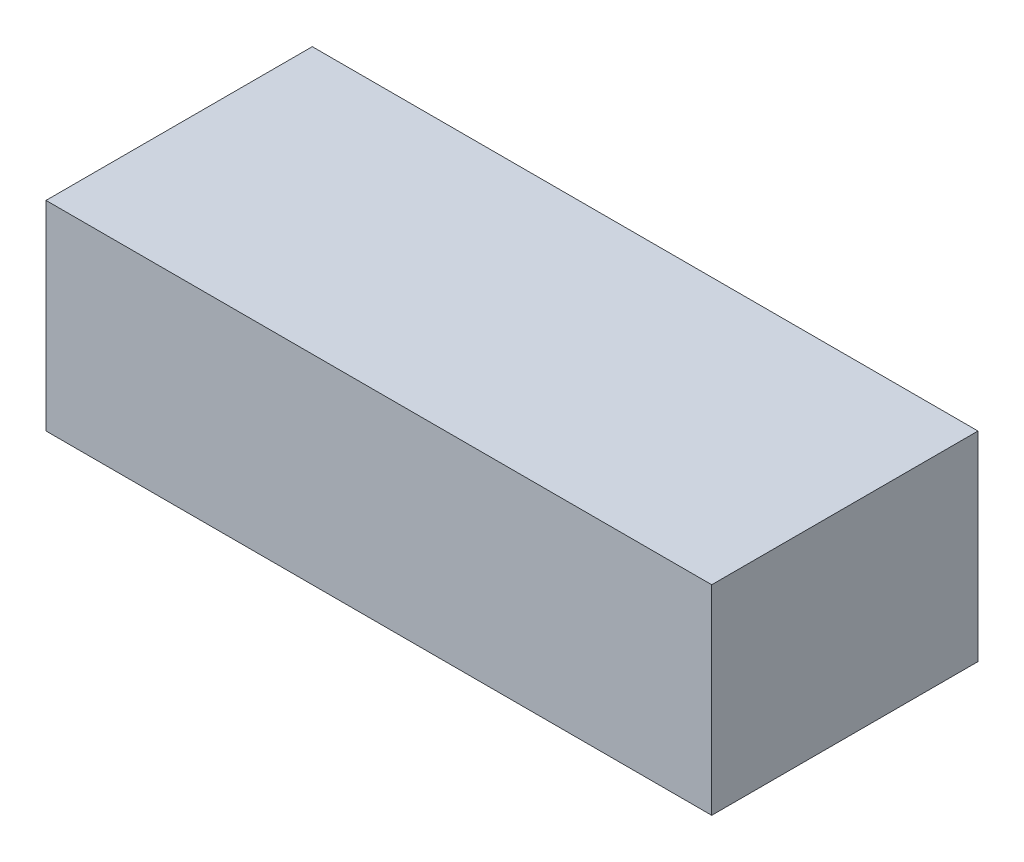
from build123d import *

# Parameters (mm, degrees)
SKIZZE1_W               = 500
SKIZZE1_H               = 150
LINEAR_AUSTRAGEN1_DEPTH = 100
SKIZZE2_R               = 5
LINEAR_AUSTRAGEN2_DEPTH = 5


with BuildPart() as part:
    # Skizze1 → Linear austragen1 (new, symmetric)
    with BuildSketch(Plane.XY):
        Rectangle(SKIZZE1_W, SKIZZE1_H)
    extrude(amount=LINEAR_AUSTRAGEN1_DEPTH, both=True)

    # Skizze2 → Linear austragen2 (add, symmetric)
    with BuildSketch(Plane.XY):
        with BuildLine():
            Line((-250, 10), (-270, 10))
            ThreePointArc((-270, 10), (-280, 0), (-270, -10))
            Line((-270, -10), (-250, -10))
            Line((-250, -10), (-250, 10))
        make_face()
        with Locations((-270, 0)):
            Circle(SKIZZE2_R, mode=Mode.SUBTRACT)
    extrude(amount=LINEAR_AUSTRAGEN2_DEPTH, both=True)


solid = part.part
